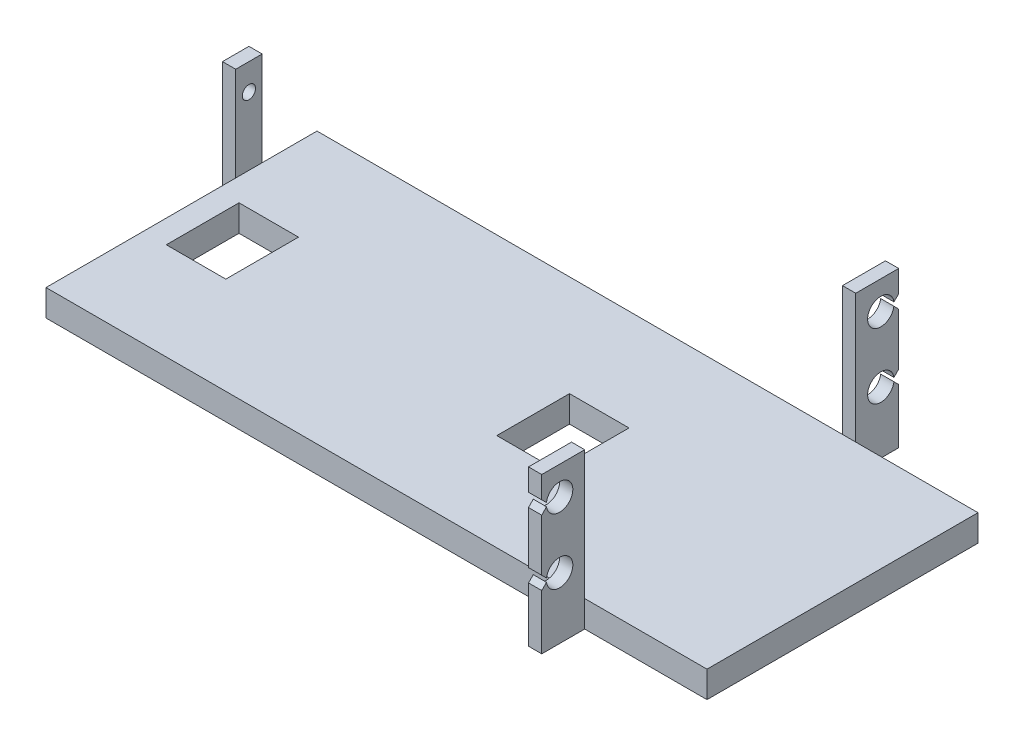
from build123d import *

# Parameters (mm, degrees)
SKETCH1_W           = 100
SKETCH1_H           = 41
BOSS_EXTRUDE1_DEPTH = 4
SKETCH2_W           = 9
SKETCH2_H           = 11
CUT_EXTRUDE2_DEPTH  = 109.15266987
SKETCH5_W           = 2
SKETCH5_H           = 4
BOSS_EXTRUDE2_DEPTH = 6.5
SKETCH6_W           = 2
SKETCH6_H           = 6.5
BOSS_EXTRUDE3_DEPTH = 19.5
SKETCH7_R           = 2
CUT_EXTRUDE3_DEPTH  = 19.5
CUT_EXTRUDE4_DEPTH  = 9
CUT_EXTRUDE7_DEPTH  = 9
SKETCH11_W          = 4
SKETCH11_H          = 4
BOSS_EXTRUDE4_DEPTH = 2
SKETCH12_W          = 2
SKETCH12_H          = 4
BOSS_EXTRUDE5_DEPTH = 14.25
SKETCH13_R          = 1
CUT_EXTRUDE6_DEPTH  = 2


with BuildPart() as part:
    # Sketch1 → Boss-Extrude1 (new body)
    with BuildSketch(Plane(origin=(0, 0, 0), x_dir=(1, 0, 0), z_dir=(0, 1, 0))):
        with Locations((50, -20.5)):
            Rectangle(SKETCH1_W, SKETCH1_H)
    extrude(amount=BOSS_EXTRUDE1_DEPTH)

    # Sketch2 → Cut-Extrude2 (cut, through all)
    with BuildSketch(Plane(origin=(0, 0, 0), x_dir=(1, 0, 0), z_dir=(0, 1, 0))):
        with Locations((8, -20.8)):
            Rectangle(SKETCH2_W, SKETCH2_H)
        with Locations((58, -20.8)):
            Rectangle(SKETCH2_W, SKETCH2_H)
    extrude(amount=CUT_EXTRUDE2_DEPTH, mode=Mode.SUBTRACT)

    # Sketch5 → Boss-Extrude2 (add)
    with BuildSketch(Plane.XY.offset(41)):
        with Locations((80.5, 2)):
            Rectangle(SKETCH5_W, SKETCH5_H)
    boss_extrude2 = extrude(amount=BOSS_EXTRUDE2_DEPTH)

    # Sketch6 → Boss-Extrude3 (add)
    with BuildSketch(Plane(origin=(0, 4, 0), x_dir=(1, 0, 0), z_dir=(0, 1, 0))):
        with Locations((80.5, -44.25)):
            Rectangle(SKETCH6_W, SKETCH6_H)
    boss_extrude3 = extrude(amount=BOSS_EXTRUDE3_DEPTH)

    # Sketch7 → Cut-Extrude3 (cut)
    with BuildSketch(Plane(origin=(81.5, 0, 0), x_dir=(0, 0, -1), z_dir=(1, 0, 0))):
        with Locations((-44.8, 19.2)):
            Circle(SKETCH7_R)
        with Locations((-44.8, 9.3)):
            Circle(SKETCH7_R)
        Polygon((-47.5, 10.3), (-46.5, 9.3), (-47.5, 8.3), align=None)
        Polygon((-47.5, 20.174856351), (-46.500316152, 19.2), (-47.5, 18.174856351), align=None)
    cut_extrude3 = extrude(amount=-CUT_EXTRUDE3_DEPTH, mode=Mode.SUBTRACT)

    # Mirror1: Boss-Extrude2, Boss-Extrude3, Cut-Extrude3 across plane
    add(boss_extrude2.mirror(Plane(origin=(0, 0, 20.5), x_dir=(1, 0, 0), z_dir=(0, 0, -1))))
    add(boss_extrude3.mirror(Plane(origin=(0, 0, 20.5), x_dir=(1, 0, 0), z_dir=(0, 0, -1))))
    add(cut_extrude3.mirror(Plane(origin=(0, 0, 20.5), x_dir=(1, 0, 0), z_dir=(0, 0, -1))), mode=Mode.SUBTRACT)

    # Sketch9 → Cut-Extrude4 (cut)
    with BuildSketch(Plane(origin=(53.5, 0, 0), x_dir=(0, 0, -1), z_dir=(1, 0, 0))):
        Polygon((-37, 1.295779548), (-36.630569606, 0), (-31.431330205, 0), (-32.191604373, 2.666666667), align=None)
    extrude(amount=CUT_EXTRUDE4_DEPTH, mode=Mode.SUBTRACT)

    # Sketch14 → Cut-Extrude7 (cut)
    with BuildSketch(Plane(origin=(3.5, 0, 0), x_dir=(0, 0, -1), z_dir=(1, 0, 0))):
        Polygon((-37, 1.295779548), (-36.630569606, 0), (-31.431330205, 0), (-32.191604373, 2.666666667), align=None)
    extrude(amount=CUT_EXTRUDE7_DEPTH, mode=Mode.SUBTRACT)

    # Sketch11 → Boss-Extrude4 (add)
    with BuildSketch(Plane.ZY):
        with Locations((10.3, 2)):
            Rectangle(SKETCH11_W, SKETCH11_H)
    extrude(amount=BOSS_EXTRUDE4_DEPTH)

    # Sketch12 → Boss-Extrude5 (add)
    with BuildSketch(Plane(origin=(0, 4, 0), x_dir=(1, 0, 0), z_dir=(0, 1, 0))):
        with Locations((-1, -10.3)):
            Rectangle(SKETCH12_W, SKETCH12_H)
    extrude(amount=BOSS_EXTRUDE5_DEPTH)

    # Sketch13 → Cut-Extrude6 (cut)
    with BuildSketch(Plane.ZY.offset(2)):
        with Locations((10.3, 14.25)):
            Circle(SKETCH13_R)
    extrude(amount=-CUT_EXTRUDE6_DEPTH, mode=Mode.SUBTRACT)


solid = part.part
